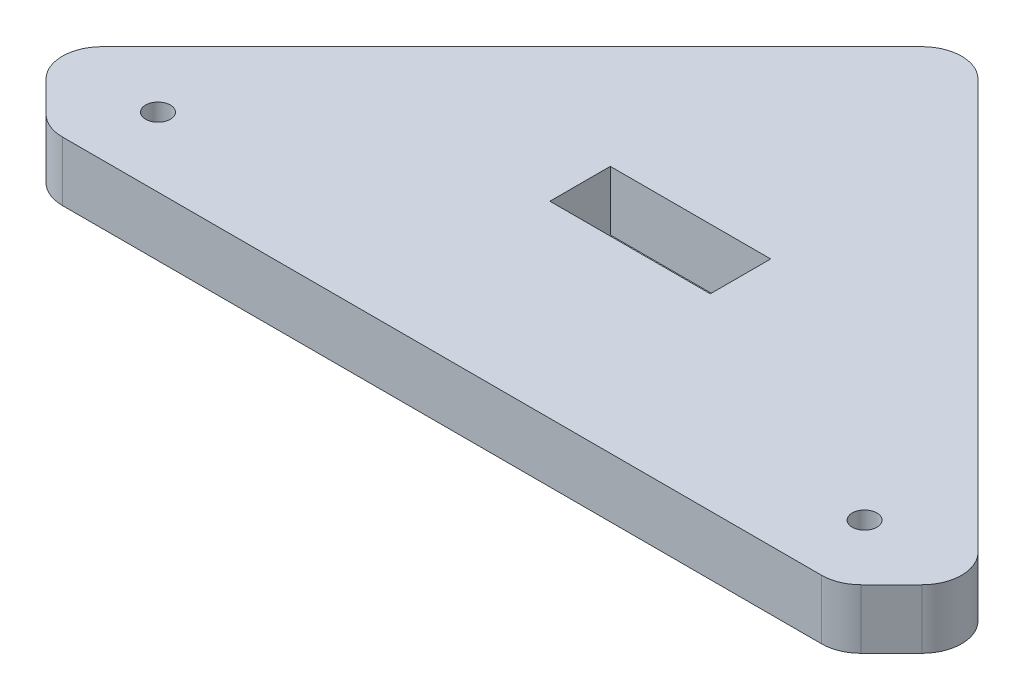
ISO-10303-21;
HEADER;
FILE_DESCRIPTION(('STEP AP214'),'2;1');
FILE_NAME('part.step','',(''),(''),'','','');
FILE_SCHEMA(('AUTOMOTIVE_DESIGN { 1 0 10303 214 1 1 1 1 }'));
ENDSEC;
DATA;
#1=APPLICATION_CONTEXT('core data for automotive mechanical design processes');
#2=APPLICATION_PROTOCOL_DEFINITION('international standard','automotive_design',2000,#1);
#3=PRODUCT_CONTEXT('',#1,'mechanical');
#4=PRODUCT('Part','Part','',(#3));
#5=PRODUCT_RELATED_PRODUCT_CATEGORY('part','',(#4));
#6=PRODUCT_DEFINITION_FORMATION('','',#4);
#7=PRODUCT_DEFINITION_CONTEXT('part definition',#1,'design');
#8=PRODUCT_DEFINITION('design','',#6,#7);
#9=PRODUCT_DEFINITION_SHAPE('','',#8);
#10=(LENGTH_UNIT() NAMED_UNIT(*) SI_UNIT(.MILLI.,.METRE.));
#11=(NAMED_UNIT(*) PLANE_ANGLE_UNIT() SI_UNIT($,.RADIAN.));
#12=(NAMED_UNIT(*) SI_UNIT($,.STERADIAN.) SOLID_ANGLE_UNIT());
#13=UNCERTAINTY_MEASURE_WITH_UNIT(LENGTH_MEASURE(1.E-05),#10,'distance_accuracy_value','');
#14=(GEOMETRIC_REPRESENTATION_CONTEXT(3) GLOBAL_UNCERTAINTY_ASSIGNED_CONTEXT((#13)) GLOBAL_UNIT_ASSIGNED_CONTEXT((#10,
#11,#12)) REPRESENTATION_CONTEXT('',''));
#15=CARTESIAN_POINT('',(0.,0.,0.));
#16=DIRECTION('',(0.,0.,1.));
#17=DIRECTION('',(1.,0.,0.));
#18=AXIS2_PLACEMENT_3D('',#15,#16,#17);
#19=CARTESIAN_POINT('',(0.,6.,0.));
#20=DIRECTION('',(0.,1.,0.));
#21=DIRECTION('',(0.,0.,1.));
#22=AXIS2_PLACEMENT_3D('',#19,#20,#21);
#23=PLANE('',#22);
#24=CARTESIAN_POINT('',(-35.6862915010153,6.,-7.));
#25=DIRECTION('',(0.,1.,0.));
#26=DIRECTION('',(0.,0.,1.));
#27=AXIS2_PLACEMENT_3D('',#24,#25,#26);
#28=CIRCLE('',#27,1.24999999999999);
#29=CARTESIAN_POINT('',(-35.6862915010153,6.,-5.75000000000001));
#30=VERTEX_POINT('',#29);
#31=EDGE_CURVE('E210',#30,#30,#28,.T.);
#32=ORIENTED_EDGE('',*,*,#31,.F.);
#33=EDGE_LOOP('',(#32));
#34=FACE_BOUND('',#33,.T.);
#35=DIRECTION('',(-0.707106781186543,0.,0.707106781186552));
#36=VECTOR('',#35,1.);
#37=CARTESIAN_POINT('',(-47.0710678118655,6.,-7.07106781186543));
#38=LINE('',#37,#36);
#39=CARTESIAN_POINT('',(-2.82842712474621,6.,-51.3137084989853));
#40=VERTEX_POINT('',#39);
#41=CARTESIAN_POINT('',(-44.2426406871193,6.,-9.89949493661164));
#42=VERTEX_POINT('',#41);
#43=EDGE_CURVE('E227',#40,#42,#38,.T.);
#44=ORIENTED_EDGE('',*,*,#43,.T.);
#45=CARTESIAN_POINT('',(-41.4142135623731,6.,-7.07106781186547));
#46=DIRECTION('',(0.,1.,0.));
#47=DIRECTION('',(0.,0.,1.));
#48=AXIS2_PLACEMENT_3D('',#45,#46,#47);
#49=CIRCLE('',#48,4.);
#50=CARTESIAN_POINT('',(-44.2426406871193,6.,-4.24264068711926));
#51=VERTEX_POINT('',#50);
#52=EDGE_CURVE('E294',#42,#51,#49,.T.);
#53=ORIENTED_EDGE('',*,*,#52,.T.);
#54=DIRECTION('',(0.707106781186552,0.,0.707106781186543));
#55=VECTOR('',#54,1.);
#56=CARTESIAN_POINT('',(-40.,6.,0.));
#57=LINE('',#56,#55);
#58=CARTESIAN_POINT('',(-41.1715728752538,6.,-1.1715728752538));
#59=VERTEX_POINT('',#58);
#60=EDGE_CURVE('E231',#51,#59,#57,.T.);
#61=ORIENTED_EDGE('',*,*,#60,.T.);
#62=CARTESIAN_POINT('',(-38.3431457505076,6.,-4.));
#63=DIRECTION('',(0.,1.,0.));
#64=DIRECTION('',(0.,0.,1.));
#65=AXIS2_PLACEMENT_3D('',#62,#63,#64);
#66=CIRCLE('',#65,4.);
#67=CARTESIAN_POINT('',(-38.3431457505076,6.,0.));
#68=VERTEX_POINT('',#67);
#69=EDGE_CURVE('E68',#59,#68,#66,.T.);
#70=ORIENTED_EDGE('',*,*,#69,.T.);
#71=DIRECTION('',(1.,0.,0.));
#72=VECTOR('',#71,1.);
#73=CARTESIAN_POINT('',(-40.,6.,0.));
#74=LINE('',#73,#72);
#75=CARTESIAN_POINT('',(38.3431457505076,6.,0.));
#76=VERTEX_POINT('',#75);
#77=EDGE_CURVE('E234',#68,#76,#74,.T.);
#78=ORIENTED_EDGE('',*,*,#77,.T.);
#79=CARTESIAN_POINT('',(38.3431457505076,6.,-4.00000000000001));
#80=DIRECTION('',(0.,1.,0.));
#81=DIRECTION('',(0.,0.,1.));
#82=AXIS2_PLACEMENT_3D('',#79,#80,#81);
#83=CIRCLE('',#82,4.);
#84=CARTESIAN_POINT('',(41.1715728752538,6.,-1.17157287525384));
#85=VERTEX_POINT('',#84);
#86=EDGE_CURVE('E283',#76,#85,#83,.T.);
#87=ORIENTED_EDGE('',*,*,#86,.T.);
#88=DIRECTION('',(0.707106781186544,0.,-0.707106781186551));
#89=VECTOR('',#88,1.);
#90=CARTESIAN_POINT('',(40.,6.,0.));
#91=LINE('',#90,#89);
#92=CARTESIAN_POINT('',(44.2426406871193,6.,-4.24264068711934));
#93=VERTEX_POINT('',#92);
#94=EDGE_CURVE('E218',#85,#93,#91,.T.);
#95=ORIENTED_EDGE('',*,*,#94,.T.);
#96=CARTESIAN_POINT('',(41.4142135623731,6.,-7.07106781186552));
#97=DIRECTION('',(0.,1.,0.));
#98=DIRECTION('',(0.,0.,1.));
#99=AXIS2_PLACEMENT_3D('',#96,#97,#98);
#100=CIRCLE('',#99,4.);
#101=CARTESIAN_POINT('',(44.2426406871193,6.,-9.89949493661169));
#102=VERTEX_POINT('',#101);
#103=EDGE_CURVE('E286',#93,#102,#100,.T.);
#104=ORIENTED_EDGE('',*,*,#103,.T.);
#105=DIRECTION('',(-0.707106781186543,0.,-0.707106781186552));
#106=VECTOR('',#105,1.);
#107=CARTESIAN_POINT('',(47.0710678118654,6.,-7.07106781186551));
#108=LINE('',#107,#106);
#109=CARTESIAN_POINT('',(2.82842712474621,6.,-51.3137084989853));
#110=VERTEX_POINT('',#109);
#111=EDGE_CURVE('E222',#102,#110,#108,.T.);
#112=ORIENTED_EDGE('',*,*,#111,.T.);
#113=CARTESIAN_POINT('',(0.,6.,-48.4852813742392));
#114=DIRECTION('',(0.,1.,0.));
#115=DIRECTION('',(0.,0.,1.));
#116=AXIS2_PLACEMENT_3D('',#113,#114,#115);
#117=CIRCLE('',#116,4.);
#118=EDGE_CURVE('E289',#110,#40,#117,.T.);
#119=ORIENTED_EDGE('',*,*,#118,.T.);
#120=EDGE_LOOP('',(#44,#53,#61,#70,#78,#87,#95,#104,#112,#119));
#121=FACE_BOUND('',#120,.T.);
#122=CARTESIAN_POINT('',(35.6862915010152,6.,-7.));
#123=DIRECTION('',(0.,1.,0.));
#124=DIRECTION('',(0.,0.,1.));
#125=AXIS2_PLACEMENT_3D('',#122,#123,#124);
#126=CIRCLE('',#125,1.24999999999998);
#127=CARTESIAN_POINT('',(35.6862915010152,6.,-5.75000000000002));
#128=VERTEX_POINT('',#127);
#129=EDGE_CURVE('E202',#128,#128,#126,.T.);
#130=ORIENTED_EDGE('',*,*,#129,.F.);
#131=EDGE_LOOP('',(#130));
#132=FACE_BOUND('',#131,.T.);
#133=DIRECTION('',(-1.,0.,0.));
#134=VECTOR('',#133,1.);
#135=CARTESIAN_POINT('',(-8.10000000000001,6.,-25.1));
#136=LINE('',#135,#134);
#137=CARTESIAN_POINT('',(8.09999999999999,6.,-25.1));
#138=VERTEX_POINT('',#137);
#139=CARTESIAN_POINT('',(-8.10000000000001,6.,-25.1));
#140=VERTEX_POINT('',#139);
#141=EDGE_CURVE('E160',#138,#140,#136,.T.);
#142=ORIENTED_EDGE('',*,*,#141,.F.);
#143=DIRECTION('',(0.,0.,-1.));
#144=VECTOR('',#143,1.);
#145=CARTESIAN_POINT('',(8.09999999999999,6.,-25.1));
#146=LINE('',#145,#144);
#147=CARTESIAN_POINT('',(8.09999999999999,6.,-19.));
#148=VERTEX_POINT('',#147);
#149=EDGE_CURVE('E149',#148,#138,#146,.T.);
#150=ORIENTED_EDGE('',*,*,#149,.F.);
#151=DIRECTION('',(1.,0.,0.));
#152=VECTOR('',#151,1.);
#153=CARTESIAN_POINT('',(-8.10000000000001,6.,-19.));
#154=LINE('',#153,#152);
#155=CARTESIAN_POINT('',(-8.10000000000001,6.,-19.));
#156=VERTEX_POINT('',#155);
#157=EDGE_CURVE('E178',#156,#148,#154,.T.);
#158=ORIENTED_EDGE('',*,*,#157,.F.);
#159=DIRECTION('',(0.,0.,1.));
#160=VECTOR('',#159,1.);
#161=CARTESIAN_POINT('',(-8.10000000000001,6.,-25.1));
#162=LINE('',#161,#160);
#163=EDGE_CURVE('E174',#140,#156,#162,.T.);
#164=ORIENTED_EDGE('',*,*,#163,.F.);
#165=EDGE_LOOP('',(#142,#150,#158,#164));
#166=FACE_BOUND('',#165,.T.);
#167=ADVANCED_FACE('F45',(#34,#121,#132,#166),#23,.T.);
#168=CARTESIAN_POINT('',(0.,0.,0.));
#169=DIRECTION('',(0.,1.,0.));
#170=DIRECTION('',(0.,0.,1.));
#171=AXIS2_PLACEMENT_3D('',#168,#169,#170);
#172=PLANE('',#171);
#173=CARTESIAN_POINT('',(35.6862915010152,0.,-7.));
#174=DIRECTION('',(0.,1.,0.));
#175=DIRECTION('',(0.,0.,1.));
#176=AXIS2_PLACEMENT_3D('',#173,#174,#175);
#177=CIRCLE('',#176,1.24999999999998);
#178=CARTESIAN_POINT('',(35.6862915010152,0.,-5.75000000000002));
#179=VERTEX_POINT('',#178);
#180=EDGE_CURVE('E169',#179,#179,#177,.T.);
#181=ORIENTED_EDGE('',*,*,#180,.T.);
#182=EDGE_LOOP('',(#181));
#183=FACE_BOUND('',#182,.T.);
#184=CARTESIAN_POINT('',(-35.6862915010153,0.,-7.));
#185=DIRECTION('',(0.,1.,0.));
#186=DIRECTION('',(0.,0.,1.));
#187=AXIS2_PLACEMENT_3D('',#184,#185,#186);
#188=CIRCLE('',#187,1.24999999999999);
#189=CARTESIAN_POINT('',(-35.6862915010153,0.,-5.75000000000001));
#190=VERTEX_POINT('',#189);
#191=EDGE_CURVE('E206',#190,#190,#188,.T.);
#192=ORIENTED_EDGE('',*,*,#191,.T.);
#193=EDGE_LOOP('',(#192));
#194=FACE_BOUND('',#193,.T.);
#195=DIRECTION('',(0.707106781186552,0.,0.707106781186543));
#196=VECTOR('',#195,1.);
#197=CARTESIAN_POINT('',(-40.,0.,0.));
#198=LINE('',#197,#196);
#199=CARTESIAN_POINT('',(-44.2426406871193,0.,-4.24264068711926));
#200=VERTEX_POINT('',#199);
#201=CARTESIAN_POINT('',(-41.1715728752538,0.,-1.1715728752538));
#202=VERTEX_POINT('',#201);
#203=EDGE_CURVE('E249',#200,#202,#198,.T.);
#204=ORIENTED_EDGE('',*,*,#203,.F.);
#205=CARTESIAN_POINT('',(-41.4142135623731,0.,-7.07106781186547));
#206=DIRECTION('',(0.,1.,0.));
#207=DIRECTION('',(0.,0.,1.));
#208=AXIS2_PLACEMENT_3D('',#205,#206,#207);
#209=CIRCLE('',#208,4.);
#210=CARTESIAN_POINT('',(-44.2426406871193,0.,-9.89949493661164));
#211=VERTEX_POINT('',#210);
#212=EDGE_CURVE('E273',#200,#211,#209,.F.);
#213=ORIENTED_EDGE('',*,*,#212,.T.);
#214=DIRECTION('',(-0.707106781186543,0.,0.707106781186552));
#215=VECTOR('',#214,1.);
#216=CARTESIAN_POINT('',(-47.0710678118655,0.,-7.07106781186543));
#217=LINE('',#216,#215);
#218=CARTESIAN_POINT('',(-2.82842712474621,0.,-51.3137084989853));
#219=VERTEX_POINT('',#218);
#220=EDGE_CURVE('E245',#219,#211,#217,.T.);
#221=ORIENTED_EDGE('',*,*,#220,.F.);
#222=CARTESIAN_POINT('',(0.,0.,-48.4852813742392));
#223=DIRECTION('',(0.,1.,0.));
#224=DIRECTION('',(0.,0.,1.));
#225=AXIS2_PLACEMENT_3D('',#222,#223,#224);
#226=CIRCLE('',#225,4.);
#227=CARTESIAN_POINT('',(2.82842712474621,0.,-51.3137084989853));
#228=VERTEX_POINT('',#227);
#229=EDGE_CURVE('E267',#219,#228,#226,.F.);
#230=ORIENTED_EDGE('',*,*,#229,.T.);
#231=DIRECTION('',(-0.707106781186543,0.,-0.707106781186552));
#232=VECTOR('',#231,1.);
#233=CARTESIAN_POINT('',(47.0710678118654,0.,-7.07106781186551));
#234=LINE('',#233,#232);
#235=CARTESIAN_POINT('',(44.2426406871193,0.,-9.89949493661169));
#236=VERTEX_POINT('',#235);
#237=EDGE_CURVE('E241',#236,#228,#234,.T.);
#238=ORIENTED_EDGE('',*,*,#237,.F.);
#239=CARTESIAN_POINT('',(41.4142135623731,0.,-7.07106781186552));
#240=DIRECTION('',(0.,1.,0.));
#241=DIRECTION('',(0.,0.,1.));
#242=AXIS2_PLACEMENT_3D('',#239,#240,#241);
#243=CIRCLE('',#242,4.);
#244=CARTESIAN_POINT('',(44.2426406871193,0.,-4.24264068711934));
#245=VERTEX_POINT('',#244);
#246=EDGE_CURVE('E264',#236,#245,#243,.F.);
#247=ORIENTED_EDGE('',*,*,#246,.T.);
#248=DIRECTION('',(0.707106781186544,0.,-0.707106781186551));
#249=VECTOR('',#248,1.);
#250=CARTESIAN_POINT('',(40.,0.,0.));
#251=LINE('',#250,#249);
#252=CARTESIAN_POINT('',(41.1715728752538,0.,-1.17157287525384));
#253=VERTEX_POINT('',#252);
#254=EDGE_CURVE('E214',#253,#245,#251,.T.);
#255=ORIENTED_EDGE('',*,*,#254,.F.);
#256=CARTESIAN_POINT('',(38.3431457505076,0.,-4.00000000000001));
#257=DIRECTION('',(0.,1.,0.));
#258=DIRECTION('',(0.,0.,1.));
#259=AXIS2_PLACEMENT_3D('',#256,#257,#258);
#260=CIRCLE('',#259,4.);
#261=CARTESIAN_POINT('',(38.3431457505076,0.,0.));
#262=VERTEX_POINT('',#261);
#263=EDGE_CURVE('E261',#253,#262,#260,.F.);
#264=ORIENTED_EDGE('',*,*,#263,.T.);
#265=DIRECTION('',(1.,0.,0.));
#266=VECTOR('',#265,1.);
#267=CARTESIAN_POINT('',(-40.,0.,0.));
#268=LINE('',#267,#266);
#269=CARTESIAN_POINT('',(-38.3431457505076,0.,0.));
#270=VERTEX_POINT('',#269);
#271=EDGE_CURVE('E223',#270,#262,#268,.T.);
#272=ORIENTED_EDGE('',*,*,#271,.F.);
#273=CARTESIAN_POINT('',(-38.3431457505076,0.,-4.));
#274=DIRECTION('',(0.,1.,0.));
#275=DIRECTION('',(0.,0.,1.));
#276=AXIS2_PLACEMENT_3D('',#273,#274,#275);
#277=CIRCLE('',#276,4.);
#278=EDGE_CURVE('E270',#270,#202,#277,.F.);
#279=ORIENTED_EDGE('',*,*,#278,.T.);
#280=EDGE_LOOP('',(#204,#213,#221,#230,#238,#247,#255,#264,#272,#279));
#281=FACE_BOUND('',#280,.T.);
#282=DIRECTION('',(0.,0.,-1.));
#283=VECTOR('',#282,1.);
#284=CARTESIAN_POINT('',(8.09999999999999,0.,-25.1));
#285=LINE('',#284,#283);
#286=CARTESIAN_POINT('',(8.09999999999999,0.,-19.));
#287=VERTEX_POINT('',#286);
#288=CARTESIAN_POINT('',(8.09999999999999,0.,-25.1));
#289=VERTEX_POINT('',#288);
#290=EDGE_CURVE('E183',#287,#289,#285,.T.);
#291=ORIENTED_EDGE('',*,*,#290,.T.);
#292=DIRECTION('',(-1.,0.,0.));
#293=VECTOR('',#292,1.);
#294=CARTESIAN_POINT('',(-8.10000000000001,0.,-25.1));
#295=LINE('',#294,#293);
#296=CARTESIAN_POINT('',(-8.10000000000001,0.,-25.1));
#297=VERTEX_POINT('',#296);
#298=EDGE_CURVE('E167',#289,#297,#295,.T.);
#299=ORIENTED_EDGE('',*,*,#298,.T.);
#300=DIRECTION('',(0.,0.,1.));
#301=VECTOR('',#300,1.);
#302=CARTESIAN_POINT('',(-8.10000000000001,0.,-25.1));
#303=LINE('',#302,#301);
#304=CARTESIAN_POINT('',(-8.10000000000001,0.,-19.));
#305=VERTEX_POINT('',#304);
#306=EDGE_CURVE('E188',#297,#305,#303,.T.);
#307=ORIENTED_EDGE('',*,*,#306,.T.);
#308=DIRECTION('',(1.,0.,0.));
#309=VECTOR('',#308,1.);
#310=CARTESIAN_POINT('',(-8.10000000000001,0.,-19.));
#311=LINE('',#310,#309);
#312=EDGE_CURVE('E161',#305,#287,#311,.T.);
#313=ORIENTED_EDGE('',*,*,#312,.T.);
#314=EDGE_LOOP('',(#291,#299,#307,#313));
#315=FACE_BOUND('',#314,.T.);
#316=ADVANCED_FACE('F321',(#183,#194,#281,#315),#172,.F.);
#317=CARTESIAN_POINT('',(40.,6.,0.));
#318=DIRECTION('',(-0.70710678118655,0.,-0.707106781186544));
#319=DIRECTION('',(-0.707106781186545,0.,0.707106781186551));
#320=AXIS2_PLACEMENT_3D('',#317,#318,#319);
#321=PLANE('',#320);
#322=ORIENTED_EDGE('',*,*,#254,.T.);
#323=DIRECTION('',(0.,-1.,0.));
#324=VECTOR('',#323,1.);
#325=CARTESIAN_POINT('',(44.2426406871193,6.,-4.24264068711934));
#326=LINE('',#325,#324);
#327=EDGE_CURVE('E11',#245,#93,#326,.F.);
#328=ORIENTED_EDGE('',*,*,#327,.T.);
#329=ORIENTED_EDGE('',*,*,#94,.F.);
#330=DIRECTION('',(0.,-1.,0.));
#331=VECTOR('',#330,1.);
#332=CARTESIAN_POINT('',(41.1715728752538,6.,-1.17157287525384));
#333=LINE('',#332,#331);
#334=EDGE_CURVE('E54',#85,#253,#333,.T.);
#335=ORIENTED_EDGE('',*,*,#334,.T.);
#336=EDGE_LOOP('',(#322,#328,#329,#335));
#337=FACE_BOUND('',#336,.T.);
#338=ADVANCED_FACE('F315',(#337),#321,.F.);
#339=CARTESIAN_POINT('',(47.0710678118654,6.,-7.07106781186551));
#340=DIRECTION('',(-0.707106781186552,0.,0.707106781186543));
#341=DIRECTION('',(0.707106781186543,0.,0.707106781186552));
#342=AXIS2_PLACEMENT_3D('',#339,#340,#341);
#343=PLANE('',#342);
#344=ORIENTED_EDGE('',*,*,#237,.T.);
#345=DIRECTION('',(0.,-1.,0.));
#346=VECTOR('',#345,1.);
#347=CARTESIAN_POINT('',(2.82842712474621,6.,-51.3137084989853));
#348=LINE('',#347,#346);
#349=EDGE_CURVE('E307',#228,#110,#348,.F.);
#350=ORIENTED_EDGE('',*,*,#349,.T.);
#351=ORIENTED_EDGE('',*,*,#111,.F.);
#352=DIRECTION('',(0.,-1.,0.));
#353=VECTOR('',#352,1.);
#354=CARTESIAN_POINT('',(44.2426406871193,6.,-9.89949493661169));
#355=LINE('',#354,#353);
#356=EDGE_CURVE('E303',#102,#236,#355,.T.);
#357=ORIENTED_EDGE('',*,*,#356,.T.);
#358=EDGE_LOOP('',(#344,#350,#351,#357));
#359=FACE_BOUND('',#358,.T.);
#360=ADVANCED_FACE('F331',(#359),#343,.F.);
#361=CARTESIAN_POINT('',(-47.0710678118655,6.,-7.07106781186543));
#362=DIRECTION('',(0.707106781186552,0.,0.707106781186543));
#363=DIRECTION('',(0.707106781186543,0.,-0.707106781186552));
#364=AXIS2_PLACEMENT_3D('',#361,#362,#363);
#365=PLANE('',#364);
#366=ORIENTED_EDGE('',*,*,#220,.T.);
#367=DIRECTION('',(0.,-1.,0.));
#368=VECTOR('',#367,1.);
#369=CARTESIAN_POINT('',(-44.2426406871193,6.,-9.89949493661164));
#370=LINE('',#369,#368);
#371=EDGE_CURVE('E280',#211,#42,#370,.F.);
#372=ORIENTED_EDGE('',*,*,#371,.T.);
#373=ORIENTED_EDGE('',*,*,#43,.F.);
#374=DIRECTION('',(0.,-1.,0.));
#375=VECTOR('',#374,1.);
#376=CARTESIAN_POINT('',(-2.82842712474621,6.,-51.3137084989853));
#377=LINE('',#376,#375);
#378=EDGE_CURVE('E276',#40,#219,#377,.T.);
#379=ORIENTED_EDGE('',*,*,#378,.T.);
#380=EDGE_LOOP('',(#366,#372,#373,#379));
#381=FACE_BOUND('',#380,.T.);
#382=ADVANCED_FACE('F341',(#381),#365,.F.);
#383=CARTESIAN_POINT('',(-40.,6.,0.));
#384=DIRECTION('',(0.707106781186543,0.,-0.707106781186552));
#385=DIRECTION('',(-0.707106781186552,0.,-0.707106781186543));
#386=AXIS2_PLACEMENT_3D('',#383,#384,#385);
#387=PLANE('',#386);
#388=ORIENTED_EDGE('',*,*,#60,.F.);
#389=DIRECTION('',(0.,-1.,0.));
#390=VECTOR('',#389,1.);
#391=CARTESIAN_POINT('',(-44.2426406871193,6.,-4.24264068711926));
#392=LINE('',#391,#390);
#393=EDGE_CURVE('E257',#51,#200,#392,.T.);
#394=ORIENTED_EDGE('',*,*,#393,.T.);
#395=ORIENTED_EDGE('',*,*,#203,.T.);
#396=DIRECTION('',(0.,-1.,0.));
#397=VECTOR('',#396,1.);
#398=CARTESIAN_POINT('',(-41.1715728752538,6.,-1.17157287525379));
#399=LINE('',#398,#397);
#400=EDGE_CURVE('E237',#202,#59,#399,.F.);
#401=ORIENTED_EDGE('',*,*,#400,.T.);
#402=EDGE_LOOP('',(#388,#394,#395,#401));
#403=FACE_BOUND('',#402,.T.);
#404=ADVANCED_FACE('F349',(#403),#387,.F.);
#405=CARTESIAN_POINT('',(-40.,6.,0.));
#406=DIRECTION('',(0.,0.,-1.));
#407=DIRECTION('',(-1.,0.,0.));
#408=AXIS2_PLACEMENT_3D('',#405,#406,#407);
#409=PLANE('',#408);
#410=ORIENTED_EDGE('',*,*,#77,.F.);
#411=DIRECTION('',(0.,-1.,0.));
#412=VECTOR('',#411,1.);
#413=CARTESIAN_POINT('',(-38.3431457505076,6.,0.));
#414=LINE('',#413,#412);
#415=EDGE_CURVE('E299',#68,#270,#414,.T.);
#416=ORIENTED_EDGE('',*,*,#415,.T.);
#417=ORIENTED_EDGE('',*,*,#271,.T.);
#418=DIRECTION('',(0.,-1.,0.));
#419=VECTOR('',#418,1.);
#420=CARTESIAN_POINT('',(38.3431457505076,6.,0.));
#421=LINE('',#420,#419);
#422=EDGE_CURVE('E61',#262,#76,#421,.F.);
#423=ORIENTED_EDGE('',*,*,#422,.T.);
#424=EDGE_LOOP('',(#410,#416,#417,#423));
#425=FACE_BOUND('',#424,.T.);
#426=ADVANCED_FACE('F354',(#425),#409,.F.);
#427=CARTESIAN_POINT('',(-35.6862915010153,6.,-7.));
#428=DIRECTION('',(0.,-1.,0.));
#429=DIRECTION('',(0.,0.,-1.));
#430=AXIS2_PLACEMENT_3D('',#427,#428,#429);
#431=CYLINDRICAL_SURFACE('',#430,1.24999999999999);
#432=ORIENTED_EDGE('',*,*,#31,.T.);
#433=EDGE_LOOP('',(#432));
#434=FACE_BOUND('',#433,.T.);
#435=ORIENTED_EDGE('',*,*,#191,.F.);
#436=EDGE_LOOP('',(#435));
#437=FACE_BOUND('',#436,.T.);
#438=ADVANCED_FACE('F370',(#434,#437),#431,.F.);
#439=CARTESIAN_POINT('',(35.6862915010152,6.,-7.));
#440=DIRECTION('',(0.,-1.,0.));
#441=DIRECTION('',(0.,0.,-1.));
#442=AXIS2_PLACEMENT_3D('',#439,#440,#441);
#443=CYLINDRICAL_SURFACE('',#442,1.24999999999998);
#444=ORIENTED_EDGE('',*,*,#129,.T.);
#445=EDGE_LOOP('',(#444));
#446=FACE_BOUND('',#445,.T.);
#447=ORIENTED_EDGE('',*,*,#180,.F.);
#448=EDGE_LOOP('',(#447));
#449=FACE_BOUND('',#448,.T.);
#450=ADVANCED_FACE('F444',(#446,#449),#443,.F.);
#451=CARTESIAN_POINT('',(8.09999999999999,6.,-25.1));
#452=DIRECTION('',(-1.,0.,0.));
#453=DIRECTION('',(0.,0.,1.));
#454=AXIS2_PLACEMENT_3D('',#451,#452,#453);
#455=PLANE('',#454);
#456=ORIENTED_EDGE('',*,*,#290,.F.);
#457=DIRECTION('',(0.,-1.,0.));
#458=VECTOR('',#457,1.);
#459=CARTESIAN_POINT('',(8.09999999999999,6.,-19.));
#460=LINE('',#459,#458);
#461=EDGE_CURVE('E155',#148,#287,#460,.T.);
#462=ORIENTED_EDGE('',*,*,#461,.F.);
#463=ORIENTED_EDGE('',*,*,#149,.T.);
#464=DIRECTION('',(0.,-1.,0.));
#465=VECTOR('',#464,1.);
#466=CARTESIAN_POINT('',(8.09999999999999,6.,-25.1));
#467=LINE('',#466,#465);
#468=EDGE_CURVE('E152',#138,#289,#467,.T.);
#469=ORIENTED_EDGE('',*,*,#468,.T.);
#470=EDGE_LOOP('',(#456,#462,#463,#469));
#471=FACE_BOUND('',#470,.T.);
#472=ADVANCED_FACE('F151',(#471),#455,.T.);
#473=CARTESIAN_POINT('',(-8.10000000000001,6.,-25.1));
#474=DIRECTION('',(0.,0.,1.));
#475=DIRECTION('',(1.,0.,0.));
#476=AXIS2_PLACEMENT_3D('',#473,#474,#475);
#477=PLANE('',#476);
#478=ORIENTED_EDGE('',*,*,#298,.F.);
#479=ORIENTED_EDGE('',*,*,#468,.F.);
#480=ORIENTED_EDGE('',*,*,#141,.T.);
#481=DIRECTION('',(0.,-1.,0.));
#482=VECTOR('',#481,1.);
#483=CARTESIAN_POINT('',(-8.10000000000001,6.,-25.1));
#484=LINE('',#483,#482);
#485=EDGE_CURVE('E170',#140,#297,#484,.T.);
#486=ORIENTED_EDGE('',*,*,#485,.T.);
#487=EDGE_LOOP('',(#478,#479,#480,#486));
#488=FACE_BOUND('',#487,.T.);
#489=ADVANCED_FACE('F164',(#488),#477,.T.);
#490=CARTESIAN_POINT('',(-8.10000000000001,6.,-25.1));
#491=DIRECTION('',(1.,0.,0.));
#492=DIRECTION('',(0.,0.,-1.));
#493=AXIS2_PLACEMENT_3D('',#490,#491,#492);
#494=PLANE('',#493);
#495=ORIENTED_EDGE('',*,*,#306,.F.);
#496=ORIENTED_EDGE('',*,*,#485,.F.);
#497=ORIENTED_EDGE('',*,*,#163,.T.);
#498=DIRECTION('',(0.,-1.,0.));
#499=VECTOR('',#498,1.);
#500=CARTESIAN_POINT('',(-8.10000000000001,6.,-19.));
#501=LINE('',#500,#499);
#502=EDGE_CURVE('E197',#156,#305,#501,.T.);
#503=ORIENTED_EDGE('',*,*,#502,.T.);
#504=EDGE_LOOP('',(#495,#496,#497,#503));
#505=FACE_BOUND('',#504,.T.);
#506=ADVANCED_FACE('F420',(#505),#494,.T.);
#507=CARTESIAN_POINT('',(-8.10000000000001,6.,-19.));
#508=DIRECTION('',(0.,0.,-1.));
#509=DIRECTION('',(-1.,0.,0.));
#510=AXIS2_PLACEMENT_3D('',#507,#508,#509);
#511=PLANE('',#510);
#512=ORIENTED_EDGE('',*,*,#312,.F.);
#513=ORIENTED_EDGE('',*,*,#502,.F.);
#514=ORIENTED_EDGE('',*,*,#157,.T.);
#515=ORIENTED_EDGE('',*,*,#461,.T.);
#516=EDGE_LOOP('',(#512,#513,#514,#515));
#517=FACE_BOUND('',#516,.T.);
#518=ADVANCED_FACE('F385',(#517),#511,.T.);
#519=CARTESIAN_POINT('',(-41.4142135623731,6.,-7.07106781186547));
#520=DIRECTION('',(0.,-1.,0.));
#521=DIRECTION('',(0.,0.,-1.));
#522=AXIS2_PLACEMENT_3D('',#519,#520,#521);
#523=CYLINDRICAL_SURFACE('',#522,4.);
#524=ORIENTED_EDGE('',*,*,#52,.F.);
#525=ORIENTED_EDGE('',*,*,#371,.F.);
#526=ORIENTED_EDGE('',*,*,#212,.F.);
#527=ORIENTED_EDGE('',*,*,#393,.F.);
#528=EDGE_LOOP('',(#524,#525,#526,#527));
#529=FACE_BOUND('',#528,.T.);
#530=ADVANCED_FACE('F346',(#529),#523,.T.);
#531=CARTESIAN_POINT('',(-38.3431457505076,6.,-4.));
#532=DIRECTION('',(0.,-1.,0.));
#533=DIRECTION('',(0.,0.,-1.));
#534=AXIS2_PLACEMENT_3D('',#531,#532,#533);
#535=CYLINDRICAL_SURFACE('',#534,4.);
#536=ORIENTED_EDGE('',*,*,#69,.F.);
#537=ORIENTED_EDGE('',*,*,#400,.F.);
#538=ORIENTED_EDGE('',*,*,#278,.F.);
#539=ORIENTED_EDGE('',*,*,#415,.F.);
#540=EDGE_LOOP('',(#536,#537,#538,#539));
#541=FACE_BOUND('',#540,.T.);
#542=ADVANCED_FACE('F353',(#541),#535,.T.);
#543=CARTESIAN_POINT('',(0.,6.,-48.4852813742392));
#544=DIRECTION('',(0.,-1.,0.));
#545=DIRECTION('',(0.,0.,-1.));
#546=AXIS2_PLACEMENT_3D('',#543,#544,#545);
#547=CYLINDRICAL_SURFACE('',#546,4.);
#548=ORIENTED_EDGE('',*,*,#118,.F.);
#549=ORIENTED_EDGE('',*,*,#349,.F.);
#550=ORIENTED_EDGE('',*,*,#229,.F.);
#551=ORIENTED_EDGE('',*,*,#378,.F.);
#552=EDGE_LOOP('',(#548,#549,#550,#551));
#553=FACE_BOUND('',#552,.T.);
#554=ADVANCED_FACE('F338',(#553),#547,.T.);
#555=CARTESIAN_POINT('',(41.4142135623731,6.,-7.07106781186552));
#556=DIRECTION('',(0.,-1.,0.));
#557=DIRECTION('',(0.,0.,-1.));
#558=AXIS2_PLACEMENT_3D('',#555,#556,#557);
#559=CYLINDRICAL_SURFACE('',#558,4.);
#560=ORIENTED_EDGE('',*,*,#103,.F.);
#561=ORIENTED_EDGE('',*,*,#327,.F.);
#562=ORIENTED_EDGE('',*,*,#246,.F.);
#563=ORIENTED_EDGE('',*,*,#356,.F.);
#564=EDGE_LOOP('',(#560,#561,#562,#563));
#565=FACE_BOUND('',#564,.T.);
#566=ADVANCED_FACE('F328',(#565),#559,.T.);
#567=CARTESIAN_POINT('',(38.3431457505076,6.,-4.00000000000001));
#568=DIRECTION('',(0.,-1.,0.));
#569=DIRECTION('',(0.,0.,-1.));
#570=AXIS2_PLACEMENT_3D('',#567,#568,#569);
#571=CYLINDRICAL_SURFACE('',#570,4.);
#572=ORIENTED_EDGE('',*,*,#86,.F.);
#573=ORIENTED_EDGE('',*,*,#422,.F.);
#574=ORIENTED_EDGE('',*,*,#263,.F.);
#575=ORIENTED_EDGE('',*,*,#334,.F.);
#576=EDGE_LOOP('',(#572,#573,#574,#575));
#577=FACE_BOUND('',#576,.T.);
#578=ADVANCED_FACE('F47',(#577),#571,.T.);
#579=CLOSED_SHELL('',(#167,#316,#338,#360,#382,#404,#426,#438,#450,#472,#489,#506,#518,#530,
#542,#554,#566,#578));
#580=MANIFOLD_SOLID_BREP('B2',#579);
#581=ADVANCED_BREP_SHAPE_REPRESENTATION('',(#18,#580),#14);
#582=SHAPE_DEFINITION_REPRESENTATION(#9,#581);
ENDSEC;
END-ISO-10303-21;
